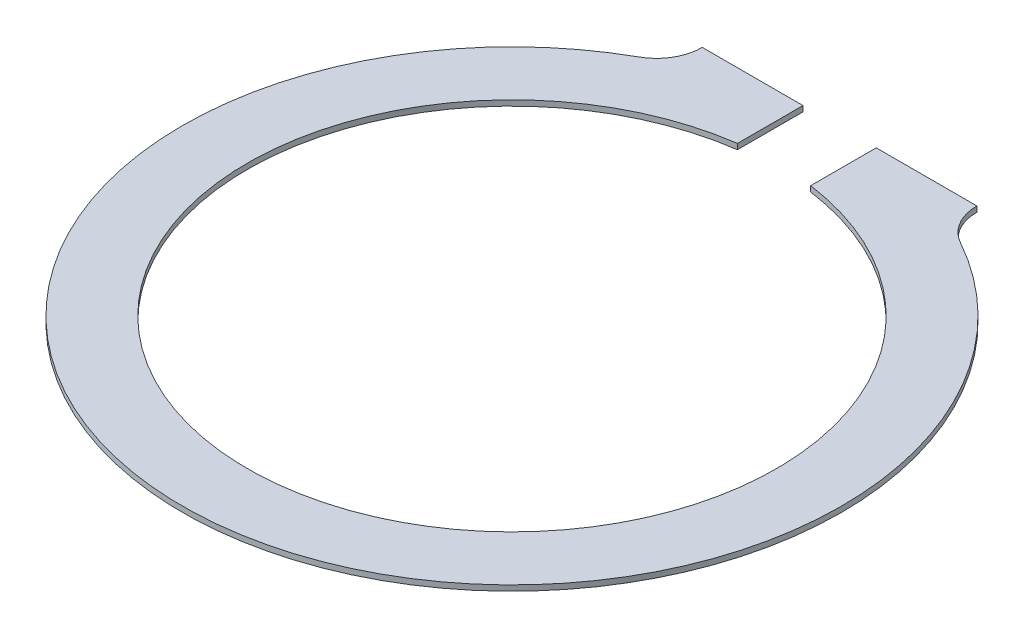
from build123d import *

# Parameters (mm, degrees)
EXTRUDE1_DEPTH = 0.1524


with BuildPart() as part:
    # Sketch1 → Extrude1 (new body)
    with BuildSketch(Plane(origin=(0, 0, 0), x_dir=(1, 0, 0), z_dir=(0, 1, 0))):
        with BuildLine():
            Line((-1.016, 7.271551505), (-1.016, 9.091101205))
            Line((-1.016, 9.091101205), (-3.8096924, 9.091101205))
            ThreePointArc((-3.8096924, 9.091101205), (-3.984331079, 8.448385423), (-4.460217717, 7.982430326))
            ThreePointArc((-4.460217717, 7.982430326), (0, -9.144), (4.460217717, 7.982430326))
            ThreePointArc((4.460217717, 7.982430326), (3.984331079, 8.448385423), (3.8096924, 9.091101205))
            Line((3.8096924, 9.091101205), (1.016, 9.091101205))
            Line((1.016, 9.091101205), (1.016, 7.271551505))
            ThreePointArc((1.016, 7.271551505), (0, -7.3421875), (-1.016, 7.271551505))
        make_face()
    extrude(amount=EXTRUDE1_DEPTH)


solid = part.part
